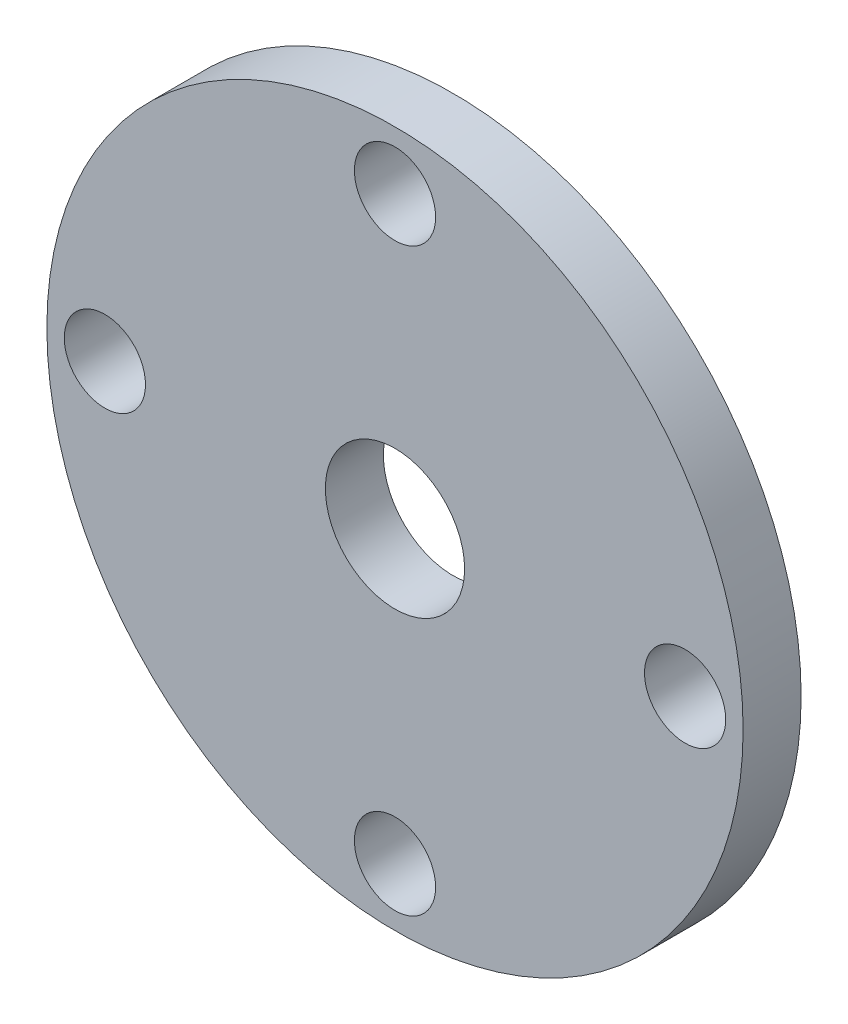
ISO-10303-21;
HEADER;
FILE_DESCRIPTION(('STEP AP214'),'2;1');
FILE_NAME('part.step','',(''),(''),'','','');
FILE_SCHEMA(('AUTOMOTIVE_DESIGN { 1 0 10303 214 1 1 1 1 }'));
ENDSEC;
DATA;
#1=APPLICATION_CONTEXT('core data for automotive mechanical design processes');
#2=APPLICATION_PROTOCOL_DEFINITION('international standard','automotive_design',2000,#1);
#3=PRODUCT_CONTEXT('',#1,'mechanical');
#4=PRODUCT('Part','Part','',(#3));
#5=PRODUCT_RELATED_PRODUCT_CATEGORY('part','',(#4));
#6=PRODUCT_DEFINITION_FORMATION('','',#4);
#7=PRODUCT_DEFINITION_CONTEXT('part definition',#1,'design');
#8=PRODUCT_DEFINITION('design','',#6,#7);
#9=PRODUCT_DEFINITION_SHAPE('','',#8);
#10=(LENGTH_UNIT() NAMED_UNIT(*) SI_UNIT(.MILLI.,.METRE.));
#11=(NAMED_UNIT(*) PLANE_ANGLE_UNIT() SI_UNIT($,.RADIAN.));
#12=(NAMED_UNIT(*) SI_UNIT($,.STERADIAN.) SOLID_ANGLE_UNIT());
#13=UNCERTAINTY_MEASURE_WITH_UNIT(LENGTH_MEASURE(1.E-05),#10,'distance_accuracy_value','');
#14=(GEOMETRIC_REPRESENTATION_CONTEXT(3) GLOBAL_UNCERTAINTY_ASSIGNED_CONTEXT((#13)) GLOBAL_UNIT_ASSIGNED_CONTEXT((#10,
#11,#12)) REPRESENTATION_CONTEXT('',''));
#15=CARTESIAN_POINT('',(0.,0.,0.));
#16=DIRECTION('',(0.,0.,1.));
#17=DIRECTION('',(1.,0.,0.));
#18=AXIS2_PLACEMENT_3D('',#15,#16,#17);
#19=CARTESIAN_POINT('',(0.,0.,5.));
#20=DIRECTION('',(0.,0.,1.));
#21=DIRECTION('',(1.,0.,0.));
#22=AXIS2_PLACEMENT_3D('',#19,#20,#21);
#23=PLANE('',#22);
#24=CARTESIAN_POINT('',(0.,-25.,5.));
#25=DIRECTION('',(0.,0.,1.));
#26=DIRECTION('',(1.,0.,0.));
#27=AXIS2_PLACEMENT_3D('',#24,#25,#26);
#28=CIRCLE('',#27,3.5);
#29=CARTESIAN_POINT('',(3.5,-25.,5.));
#30=VERTEX_POINT('',#29);
#31=EDGE_CURVE('E58',#30,#30,#28,.T.);
#32=ORIENTED_EDGE('',*,*,#31,.F.);
#33=EDGE_LOOP('',(#32));
#34=FACE_BOUND('',#33,.T.);
#35=CARTESIAN_POINT('',(0.,25.,5.));
#36=DIRECTION('',(0.,0.,1.));
#37=DIRECTION('',(1.,0.,0.));
#38=AXIS2_PLACEMENT_3D('',#35,#36,#37);
#39=CIRCLE('',#38,3.5);
#40=CARTESIAN_POINT('',(3.5,25.,5.));
#41=VERTEX_POINT('',#40);
#42=EDGE_CURVE('E46',#41,#41,#39,.T.);
#43=ORIENTED_EDGE('',*,*,#42,.F.);
#44=EDGE_LOOP('',(#43));
#45=FACE_BOUND('',#44,.T.);
#46=CARTESIAN_POINT('',(0.,0.,5.));
#47=DIRECTION('',(0.,0.,1.));
#48=DIRECTION('',(1.,0.,0.));
#49=AXIS2_PLACEMENT_3D('',#46,#47,#48);
#50=CIRCLE('',#49,30.);
#51=CARTESIAN_POINT('',(30.,0.,5.));
#52=VERTEX_POINT('',#51);
#53=EDGE_CURVE('E10',#52,#52,#50,.T.);
#54=ORIENTED_EDGE('',*,*,#53,.T.);
#55=EDGE_LOOP('',(#54));
#56=FACE_BOUND('',#55,.T.);
#57=CARTESIAN_POINT('',(0.,0.,5.));
#58=DIRECTION('',(0.,0.,1.));
#59=DIRECTION('',(1.,0.,0.));
#60=AXIS2_PLACEMENT_3D('',#57,#58,#59);
#61=CIRCLE('',#60,6.);
#62=CARTESIAN_POINT('',(6.,0.,5.));
#63=VERTEX_POINT('',#62);
#64=EDGE_CURVE('E41',#63,#63,#61,.T.);
#65=ORIENTED_EDGE('',*,*,#64,.F.);
#66=EDGE_LOOP('',(#65));
#67=FACE_BOUND('',#66,.T.);
#68=CARTESIAN_POINT('',(25.,0.,5.));
#69=DIRECTION('',(0.,0.,1.));
#70=DIRECTION('',(1.,0.,0.));
#71=AXIS2_PLACEMENT_3D('',#68,#69,#70);
#72=CIRCLE('',#71,3.5);
#73=CARTESIAN_POINT('',(28.5,0.,5.));
#74=VERTEX_POINT('',#73);
#75=EDGE_CURVE('E52',#74,#74,#72,.T.);
#76=ORIENTED_EDGE('',*,*,#75,.F.);
#77=EDGE_LOOP('',(#76));
#78=FACE_BOUND('',#77,.T.);
#79=CARTESIAN_POINT('',(-25.,0.,5.));
#80=DIRECTION('',(0.,0.,1.));
#81=DIRECTION('',(1.,0.,0.));
#82=AXIS2_PLACEMENT_3D('',#79,#80,#81);
#83=CIRCLE('',#82,3.5);
#84=CARTESIAN_POINT('',(-21.5,0.,5.));
#85=VERTEX_POINT('',#84);
#86=EDGE_CURVE('E64',#85,#85,#83,.T.);
#87=ORIENTED_EDGE('',*,*,#86,.F.);
#88=EDGE_LOOP('',(#87));
#89=FACE_BOUND('',#88,.T.);
#90=ADVANCED_FACE('F30',(#34,#45,#56,#67,#78,#89),#23,.T.);
#91=CARTESIAN_POINT('',(0.,0.,0.));
#92=DIRECTION('',(0.,0.,1.));
#93=DIRECTION('',(1.,0.,0.));
#94=AXIS2_PLACEMENT_3D('',#91,#92,#93);
#95=PLANE('',#94);
#96=CARTESIAN_POINT('',(0.,0.,0.));
#97=DIRECTION('',(0.,0.,1.));
#98=DIRECTION('',(1.,0.,0.));
#99=AXIS2_PLACEMENT_3D('',#96,#97,#98);
#100=CIRCLE('',#99,30.);
#101=CARTESIAN_POINT('',(30.,0.,0.));
#102=VERTEX_POINT('',#101);
#103=EDGE_CURVE('E34',#102,#102,#100,.T.);
#104=ORIENTED_EDGE('',*,*,#103,.F.);
#105=EDGE_LOOP('',(#104));
#106=FACE_BOUND('',#105,.T.);
#107=CARTESIAN_POINT('',(0.,0.,0.));
#108=DIRECTION('',(0.,0.,1.));
#109=DIRECTION('',(1.,0.,0.));
#110=AXIS2_PLACEMENT_3D('',#107,#108,#109);
#111=CIRCLE('',#110,6.);
#112=CARTESIAN_POINT('',(6.,0.,0.));
#113=VERTEX_POINT('',#112);
#114=EDGE_CURVE('E43',#113,#113,#111,.T.);
#115=ORIENTED_EDGE('',*,*,#114,.T.);
#116=EDGE_LOOP('',(#115));
#117=FACE_BOUND('',#116,.T.);
#118=CARTESIAN_POINT('',(0.,25.,0.));
#119=DIRECTION('',(0.,0.,1.));
#120=DIRECTION('',(1.,0.,0.));
#121=AXIS2_PLACEMENT_3D('',#118,#119,#120);
#122=CIRCLE('',#121,3.5);
#123=CARTESIAN_POINT('',(3.5,25.,0.));
#124=VERTEX_POINT('',#123);
#125=EDGE_CURVE('E49',#124,#124,#122,.T.);
#126=ORIENTED_EDGE('',*,*,#125,.T.);
#127=EDGE_LOOP('',(#126));
#128=FACE_BOUND('',#127,.T.);
#129=CARTESIAN_POINT('',(25.,0.,0.));
#130=DIRECTION('',(0.,0.,1.));
#131=DIRECTION('',(1.,0.,0.));
#132=AXIS2_PLACEMENT_3D('',#129,#130,#131);
#133=CIRCLE('',#132,3.5);
#134=CARTESIAN_POINT('',(28.5,0.,0.));
#135=VERTEX_POINT('',#134);
#136=EDGE_CURVE('E55',#135,#135,#133,.T.);
#137=ORIENTED_EDGE('',*,*,#136,.T.);
#138=EDGE_LOOP('',(#137));
#139=FACE_BOUND('',#138,.T.);
#140=CARTESIAN_POINT('',(0.,-25.,0.));
#141=DIRECTION('',(0.,0.,1.));
#142=DIRECTION('',(1.,0.,0.));
#143=AXIS2_PLACEMENT_3D('',#140,#141,#142);
#144=CIRCLE('',#143,3.5);
#145=CARTESIAN_POINT('',(3.5,-25.,0.));
#146=VERTEX_POINT('',#145);
#147=EDGE_CURVE('E61',#146,#146,#144,.T.);
#148=ORIENTED_EDGE('',*,*,#147,.T.);
#149=EDGE_LOOP('',(#148));
#150=FACE_BOUND('',#149,.T.);
#151=CARTESIAN_POINT('',(-25.,0.,0.));
#152=DIRECTION('',(0.,0.,1.));
#153=DIRECTION('',(1.,0.,0.));
#154=AXIS2_PLACEMENT_3D('',#151,#152,#153);
#155=CIRCLE('',#154,3.5);
#156=CARTESIAN_POINT('',(-21.5,0.,0.));
#157=VERTEX_POINT('',#156);
#158=EDGE_CURVE('E67',#157,#157,#155,.T.);
#159=ORIENTED_EDGE('',*,*,#158,.T.);
#160=EDGE_LOOP('',(#159));
#161=FACE_BOUND('',#160,.T.);
#162=ADVANCED_FACE('F77',(#106,#117,#128,#139,#150,#161),#95,.F.);
#163=CARTESIAN_POINT('',(0.,0.,5.));
#164=DIRECTION('',(0.,0.,-1.));
#165=DIRECTION('',(-1.,0.,0.));
#166=AXIS2_PLACEMENT_3D('',#163,#164,#165);
#167=CYLINDRICAL_SURFACE('',#166,30.);
#168=ORIENTED_EDGE('',*,*,#53,.F.);
#169=EDGE_LOOP('',(#168));
#170=FACE_BOUND('',#169,.T.);
#171=ORIENTED_EDGE('',*,*,#103,.T.);
#172=EDGE_LOOP('',(#171));
#173=FACE_BOUND('',#172,.T.);
#174=ADVANCED_FACE('F32',(#170,#173),#167,.T.);
#175=CARTESIAN_POINT('',(0.,0.,5.));
#176=DIRECTION('',(0.,0.,-1.));
#177=DIRECTION('',(-1.,0.,0.));
#178=AXIS2_PLACEMENT_3D('',#175,#176,#177);
#179=CYLINDRICAL_SURFACE('',#178,6.);
#180=ORIENTED_EDGE('',*,*,#64,.T.);
#181=EDGE_LOOP('',(#180));
#182=FACE_BOUND('',#181,.T.);
#183=ORIENTED_EDGE('',*,*,#114,.F.);
#184=EDGE_LOOP('',(#183));
#185=FACE_BOUND('',#184,.T.);
#186=ADVANCED_FACE('F87',(#182,#185),#179,.F.);
#187=CARTESIAN_POINT('',(0.,25.,5.));
#188=DIRECTION('',(0.,0.,-1.));
#189=DIRECTION('',(-1.,0.,0.));
#190=AXIS2_PLACEMENT_3D('',#187,#188,#189);
#191=CYLINDRICAL_SURFACE('',#190,3.5);
#192=ORIENTED_EDGE('',*,*,#42,.T.);
#193=EDGE_LOOP('',(#192));
#194=FACE_BOUND('',#193,.T.);
#195=ORIENTED_EDGE('',*,*,#125,.F.);
#196=EDGE_LOOP('',(#195));
#197=FACE_BOUND('',#196,.T.);
#198=ADVANCED_FACE('F90',(#194,#197),#191,.F.);
#199=CARTESIAN_POINT('',(25.,0.,5.));
#200=DIRECTION('',(0.,0.,-1.));
#201=DIRECTION('',(-1.,0.,0.));
#202=AXIS2_PLACEMENT_3D('',#199,#200,#201);
#203=CYLINDRICAL_SURFACE('',#202,3.5);
#204=ORIENTED_EDGE('',*,*,#75,.T.);
#205=EDGE_LOOP('',(#204));
#206=FACE_BOUND('',#205,.T.);
#207=ORIENTED_EDGE('',*,*,#136,.F.);
#208=EDGE_LOOP('',(#207));
#209=FACE_BOUND('',#208,.T.);
#210=ADVANCED_FACE('F94',(#206,#209),#203,.F.);
#211=CARTESIAN_POINT('',(0.,-25.,5.));
#212=DIRECTION('',(0.,0.,-1.));
#213=DIRECTION('',(-1.,0.,0.));
#214=AXIS2_PLACEMENT_3D('',#211,#212,#213);
#215=CYLINDRICAL_SURFACE('',#214,3.5);
#216=ORIENTED_EDGE('',*,*,#31,.T.);
#217=EDGE_LOOP('',(#216));
#218=FACE_BOUND('',#217,.T.);
#219=ORIENTED_EDGE('',*,*,#147,.F.);
#220=EDGE_LOOP('',(#219));
#221=FACE_BOUND('',#220,.T.);
#222=ADVANCED_FACE('F98',(#218,#221),#215,.F.);
#223=CARTESIAN_POINT('',(-25.,0.,5.));
#224=DIRECTION('',(0.,0.,-1.));
#225=DIRECTION('',(-1.,0.,0.));
#226=AXIS2_PLACEMENT_3D('',#223,#224,#225);
#227=CYLINDRICAL_SURFACE('',#226,3.5);
#228=ORIENTED_EDGE('',*,*,#86,.T.);
#229=EDGE_LOOP('',(#228));
#230=FACE_BOUND('',#229,.T.);
#231=ORIENTED_EDGE('',*,*,#158,.F.);
#232=EDGE_LOOP('',(#231));
#233=FACE_BOUND('',#232,.T.);
#234=ADVANCED_FACE('F73',(#230,#233),#227,.F.);
#235=CLOSED_SHELL('',(#90,#162,#174,#186,#198,#210,#222,#234));
#236=MANIFOLD_SOLID_BREP('B2',#235);
#237=ADVANCED_BREP_SHAPE_REPRESENTATION('',(#18,#236),#14);
#238=SHAPE_DEFINITION_REPRESENTATION(#9,#237);
ENDSEC;
END-ISO-10303-21;
